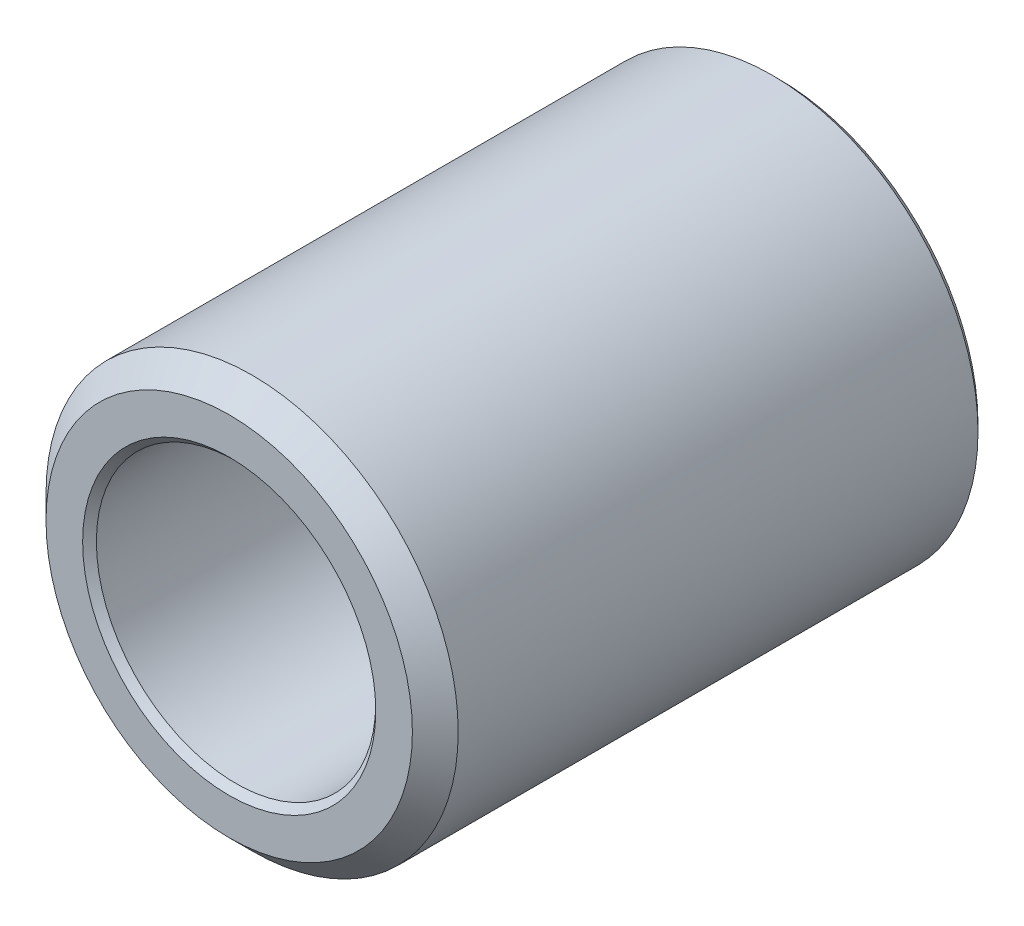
from build123d import *

# Parameters (mm, degrees)
SKETCH_1_R      = 4.5
SKETCH_1_R_2    = 3.05
EXTRUDE_1_DEPTH = 12
CHAMFER_1_SIZE  = 0.5
CHAMFER_2_SIZE  = 0.15


with BuildPart() as part:
    # Sketch 1 → Extrude 1 (new body)
    with BuildSketch(Plane.XY):
        Circle(SKETCH_1_R)
        Circle(SKETCH_1_R_2, mode=Mode.SUBTRACT)
    extrude(amount=EXTRUDE_1_DEPTH)

    # Chamfer 1
    chamfer_1_edges = [part.edges().sort_by_distance(p)[0] for p in [
        (-4.5, 0, 12),
    ]]
    chamfer(chamfer_1_edges, length=CHAMFER_1_SIZE)

    # Chamfer 2
    chamfer_2_edges = [part.edges().sort_by_distance(p)[0] for p in [
        (-4.5, 0, 0),
        (-3.05, 0, 0),
        (-3.05, 0, 12),
    ]]
    chamfer(chamfer_2_edges, length=CHAMFER_2_SIZE)


solid = part.part
